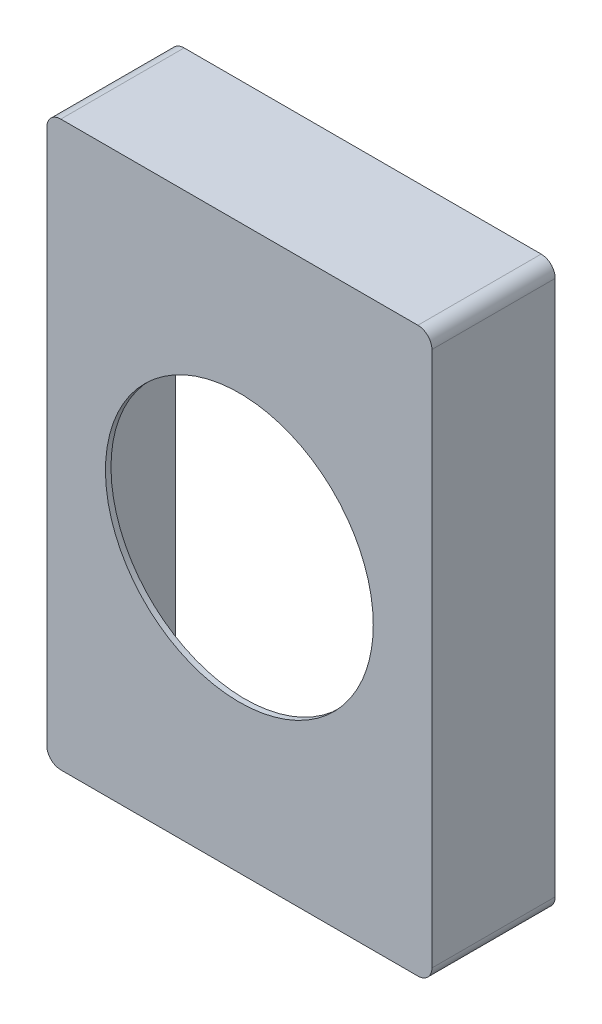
from build123d import *
from build123d.topology import SkipClean

# Parameters (mm, degrees)
ESQUISSE1_R             = 31
ESQUISSE1_R_2           = 28
BOSS_EXTRU_1_DEPTH      = 7.5
BOSS_EXTRU_9_START      = -2.75
BOSS_EXTRU_9_DEPTH      = 2.75
BOSS_EXTRU_10_START     = -7.5
BOSS_EXTRU_10_DEPTH     = 7.5
ESQUISSE24_R            = 28
BOSS_EXTRU_11_DEPTH     = 1.3
BOSS_EXTRU_12_START     = -1.3
ESQUISSE25_W            = 88
ESQUISSE25_H            = 130
ESQUISSE25_R            = 31
BOSS_EXTRU_12_DEPTH     = 1.3
ESQUISSE26_W            = 90.6
ESQUISSE26_H            = 132.6
ESQUISSE26_W_2          = 88
ESQUISSE26_H_2          = 130
BOSS_EXTRU_13_DEPTH     = 29
ESQUISSE34_R            = 31.5
ENL_V_MAT_EXTRU_2_DEPTH = 8.5
ESQUISSE28_R            = 5
BOSS_EXTRU_14_DEPTH     = 15
ESQUISSE29_R            = 2.5
BOSS_EXTRU_15_DEPTH     = 3
CONG_1_R                = 2
CONG_2_R                = 3.3
ENL_V_START             = -8.5
ESQUISSE35_R            = 31.5
ENL_V_MAT_EXTRU_3_DEPTH = 8.5


with BuildPart() as part:
    # Esquisse1 → Boss.-Extru.1 (new body)
    with BuildSketch(Plane.XY):
        Circle(ESQUISSE1_R)
        Circle(ESQUISSE1_R_2, mode=Mode.SUBTRACT)
    extrude(amount=BOSS_EXTRU_1_DEPTH)

    # Esquisse22 → Boss.-Extru.9 (add)
    with BuildSketch(Plane.XY.offset(7.5).offset(BOSS_EXTRU_9_START)):
        with BuildLine():
            Line((-27.928480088, 2), (-23.916521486, 2))
            ThreePointArc((-23.916521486, 2), (-22.457291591, 8.465816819), (-19.285063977, 14.285877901))
            Line((-19.285063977, 14.285877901), (-22.499241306, 16.666857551))
            ThreePointArc((-22.499241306, 16.666857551), (-26.258673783, 9.720187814), (-27.928480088, 2))
        make_face()
        with BuildLine():
            ThreePointArc((2, 23.916521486), (8.465816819, 22.457291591), (14.285877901, 19.285063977))
            Line((14.285877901, 19.285063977), (16.666857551, 22.499241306))
            ThreePointArc((16.666857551, 22.499241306), (9.720187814, 26.258673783), (2, 27.928480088))
            Line((2, 27.928480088), (2, 23.916521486))
        make_face()
        with BuildLine():
            Line((27.928480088, -2), (23.916521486, -2))
            ThreePointArc((23.916521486, -2), (22.457291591, -8.465816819), (19.285063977, -14.285877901))
            Line((19.285063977, -14.285877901), (22.499241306, -16.666857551))
            ThreePointArc((22.499241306, -16.666857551), (26.258673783, -9.720187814), (27.928480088, -2))
        make_face()
        with BuildLine():
            Line((-2, -27.928480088), (-2, -23.916521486))
            ThreePointArc((-2, -23.916521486), (-8.465816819, -22.457291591), (-14.285877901, -19.285063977))
            Line((-14.285877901, -19.285063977), (-16.666857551, -22.499241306))
            ThreePointArc((-16.666857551, -22.499241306), (-9.720187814, -26.258673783), (-2, -27.928480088))
        make_face()
    extrude(amount=BOSS_EXTRU_9_DEPTH)

    # Esquisse23 → Boss.-Extru.10 (add)
    with BuildSketch(Plane.XY.offset(7.5).offset(BOSS_EXTRU_10_START)):
        with BuildLine():
            Line((-27.996515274, -0.44173803), (-23.999823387, -0.092072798))
            ThreePointArc((-23.999823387, -0.092072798), (-23.980997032, 0.954872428), (-23.916521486, 2))
            Line((-23.916521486, 2), (-27.928480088, 2))
            ThreePointArc((-27.928480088, 2), (-27.989137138, 0.779873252), (-27.996515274, -0.44173803))
        make_face()
        with BuildLine():
            Line((-0.44173803, 27.996515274), (-0.092072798, 23.999823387))
            ThreePointArc((-0.092072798, 23.999823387), (0.954872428, 23.980997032), (2, 23.916521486))
            Line((2, 23.916521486), (2, 27.928480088))
            ThreePointArc((2, 27.928480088), (0.779873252, 27.989137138), (-0.44173803, 27.996515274))
        make_face()
        with BuildLine():
            ThreePointArc((24, 0), (23.97912129, -1.000870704), (23.916521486, -2))
            Line((23.916521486, -2), (27.928480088, -2))
            ThreePointArc((27.928480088, -2), (27.982114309, -1.000639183), (28, 0))
            ThreePointArc((28, 0), (27.999128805, 0.220875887), (27.996515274, 0.44173803))
            Line((27.996515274, 0.44173803), (23.999823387, 0.092072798))
            ThreePointArc((23.999823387, 0.092072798), (23.999955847, 0.046036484), (24, 0))
        make_face()
        with BuildLine():
            Line((0.44173803, -27.996515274), (0.092072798, -23.999823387))
            ThreePointArc((0.092072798, -23.999823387), (-0.954872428, -23.980997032), (-2, -23.916521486))
            Line((-2, -23.916521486), (-2, -27.928480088))
            ThreePointArc((-2, -27.928480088), (-0.779873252, -27.989137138), (0.44173803, -27.996515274))
        make_face()
    extrude(amount=BOSS_EXTRU_10_DEPTH)

    # Esquisse24 → Boss.-Extru.11 (add)
    with BuildSketch(Plane(origin=(0, 0, 0), x_dir=(-1, 0, 0), z_dir=(0, 0, -1))):
        Circle(ESQUISSE24_R)
    extrude(amount=-BOSS_EXTRU_11_DEPTH)

    # Esquisse25 → Boss.-Extru.12 (add)
    with BuildSketch(Plane.XY.offset(7.5).offset(BOSS_EXTRU_12_START)):
        Rectangle(ESQUISSE25_W, ESQUISSE25_H)
        Circle(ESQUISSE25_R, mode=Mode.SUBTRACT)
    extrude(amount=BOSS_EXTRU_12_DEPTH)

    # Esquisse26 → Boss.-Extru.13 (add)
    with BuildSketch(Plane.XY.offset(7.5)):
        Rectangle(ESQUISSE26_W, ESQUISSE26_H)
        Rectangle(ESQUISSE26_W_2, ESQUISSE26_H_2, mode=Mode.SUBTRACT)
    extrude(amount=-BOSS_EXTRU_13_DEPTH)

    # Esquisse34 → Enl_v. mat.-Extru.2 (cut)
    with BuildSketch(Plane(origin=(0, 0, 0), x_dir=(-1, 0, 0), z_dir=(0, 0, -1))):
        with Locations(Location((0, 0, 0), (0, 0, 180))):
            Circle(ESQUISSE34_R)
    extrude(amount=-ENL_V_MAT_EXTRU_2_DEPTH, mode=Mode.SUBTRACT)

    # Esquisse28 → Boss.-Extru.14 (add)
    with BuildSketch(Plane(origin=(0, 0, 6.2), x_dir=(-1, 0, 0), z_dir=(0, 0, -1))):
        with Locations(Location((-33, -54.5, 0), (0, 0, 180))):
            Circle(ESQUISSE28_R)
        with Locations(Location((33, -51, 0), (0, 0, 180))):
            Circle(ESQUISSE28_R)
        with Locations(Location((33.5, 55, 0), (0, 0, 180))):
            Circle(ESQUISSE28_R)
        with Locations(Location((-31, 52, 0), (0, 0, 180))):
            Circle(ESQUISSE28_R)
        with Locations(Location((-32, -8.5, 0), (0, 0, 81.945178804))):
            Circle(ESQUISSE28_R)
    extrude(amount=BOSS_EXTRU_14_DEPTH)

    # Esquisse29 → Boss.-Extru.15 (add)
    with BuildSketch(Plane(origin=(0, 0, -8.8), x_dir=(-1, 0, 0), z_dir=(0, 0, -1))):
        with Locations((-33, -54.5)):
            Circle(ESQUISSE29_R)
        with Locations((33, -51)):
            Circle(ESQUISSE29_R)
        with Locations((-32, -8.5)):
            Circle(ESQUISSE29_R)
        with Locations((-31, 52)):
            Circle(ESQUISSE29_R)
        with Locations((33.5, 55)):
            Circle(ESQUISSE29_R)
    extrude(amount=BOSS_EXTRU_15_DEPTH)

    # Cong_1
    cong_1_edges = [part.edges().sort_by_distance(p)[0] for p in [
        (-44, 65, -7.65),
        (44, 65, -7.65),
        (44, -65, -7.65),
        (-44, -65, -7.65),
    ]]
    fillet(cong_1_edges, radius=CONG_1_R)

    # Cong_2
    cong_2_edges = [part.edges().sort_by_distance(p)[0] for p in [
        (-45.3, 66.3, -7),
        (45.3, 66.3, -7),
        (45.3, -66.3, -7),
        (-45.3, -66.3, -7),
    ]]
    fillet(cong_2_edges, radius=CONG_2_R)

    # Esquisse35 → Enl_v. mat.-Extru.3 (cut)
    with SkipClean():  # the faces are left unmerged after this step: merging them gives an invalid solid
        with BuildSketch(Plane.XY.offset(7.5).offset(ENL_V_START)):
            with Locations(Location((0, 0, 0), (0, 0, 336.718296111))):
                Circle(ESQUISSE35_R)
        extrude(amount=ENL_V_MAT_EXTRU_3_DEPTH, mode=Mode.SUBTRACT)


solid = part.part
